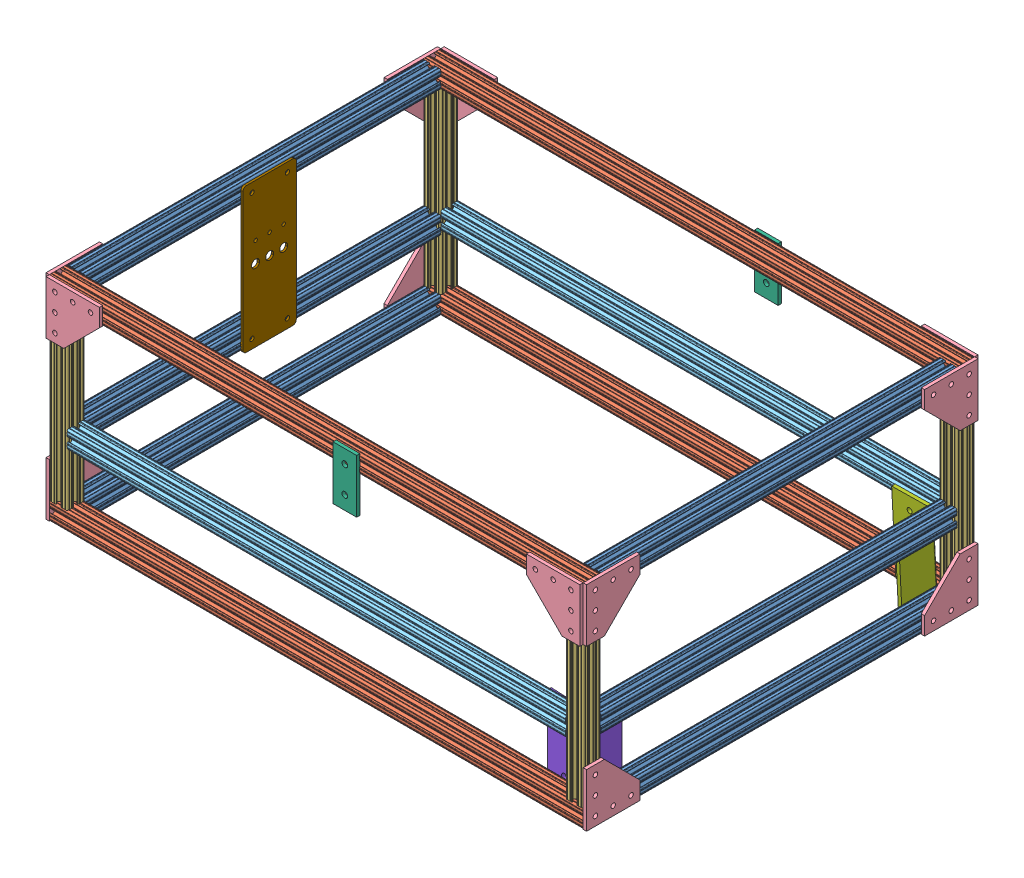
SolidWorks assembly Base Without Wheels+Plate+Angle iron+Switch Plate.SLDASM, configuration Default (file format 11000). Lengths in mm.
Overall size (771.55 304.86 568.83).
33 component instances, 9 part files, 78 mates.
Components (placement in the parent):
- 1010 20in-2: 1010 20in.SLDPRT [Default] at (231.3281 508 268.5426) size (25.4 25.4 508)
- 1010 30in-1: 1010 30in.SLDPRT [Default] at (-517.9719 508 281.2426) x (0 0 1) z (-1 0 0) size (25.4 25.4 762)
- 1010 30in-2: 1010 30in.SLDPRT [Default] at (-517.9719 508 -252.1574) x (0 0 1) z (-1 0 0) size (25.4 25.4 762)
- 1010 20in-3: 1010 20in.SLDPRT [Default] at (-505.2719 508 268.5426) size (25.4 25.4 508)
- 1010 10in-1: 1010 10in.SLDPRT [Default] at (231.3281 520.7 281.2426) x (1 0 0) z (0 -1 0) size (25.4 25.4 254)
- 1010 10in-2: 1010 10in.SLDPRT [Default] at (231.3281 520.7 -252.1574) x (1 0 0) z (0 -1 0) size (25.4 25.4 254)
- 1010 10in-3: 1010 10in.SLDPRT [Default] at (-505.2719 520.7 -252.1574) x (1 0 0) z (0 -1 0) size (25.4 25.4 254)
- 1010 10in-4: 1010 10in.SLDPRT [Default] at (-505.2719 520.7 281.2426) x (1 0 0) z (0 -1 0) size (25.4 25.4 254)
- 1010 30in-3: 1010 30in.SLDPRT [Default] at (244.0281 787.4 -252.1574) x (0 0 -1) z (1 0 0) size (25.4 25.4 762)
- 1010 20in-4: 1010 20in.SLDPRT [Default] at (231.3281 787.4 268.5426) size (25.4 25.4 508)
- 1010 30in-4: 1010 30in.SLDPRT [Default] at (-517.9719 787.4 281.2426) x (0 -1 0) z (-1 0 0) size (25.4 25.4 762)
- 1010 20in-5: 1010 20in.SLDPRT [Default] at (-505.2719 787.4 268.5426) size (25.4 25.4 508)
- 4151-1: 4151.sldprt [Default] at (248.8033 495.3 255.8426) x (0 0 1) z (-1 0 0) size (76.2 76.2 4.78)
- 4151-2: 4151.sldprt [Default] at (244.0281 495.3 -226.7574) x (0 0 -1) z (1 0 0) size (76.2 76.2 4.78)
- 4151-3: 4151.sldprt [Default] at (-522.7471 533.4 293.9426) x (0 -1 0) z (1 0 0) size (76.2 76.2 4.78)
- 4151-4: 4151.sldprt [Default] at (-522.7471 495.3 -226.7574) x (0 0 -1) z (1 0 0) size (76.2 76.2 4.78)
- 4151-5: 4151.sldprt [Default] at (248.8033 800.1 -226.7574) x (0 0 -1) z (-1 0 0) size (76.2 76.2 4.78)
- 4151-6: 4151.sldprt [Default] at (248.8033 762 293.9426) x (0 1 0) z (-1 0 0) size (76.2 76.2 4.78)
- 4151-7: 4151.sldprt [Default] at (244.0281 762 293.9426) x (0 1 0) z (0 0 1) size (76.2 76.2 4.78)
- 4151-8: 4151.sldprt [Default] at (244.0281 762 -269.6326) x (0 1 0) z (0 0 1) size (76.2 76.2 4.78)
- 4151-9: 4151.sldprt [Default] at (-522.7471 762 -264.8574) x (0 1 0) z (1 0 0) size (76.2 76.2 4.78)
- 4151-10: 4151.sldprt [Default] at (-522.7471 800.1 255.8426) x (0 0 1) z (1 0 0) size (76.2 76.2 4.78)
- 4151-11: 4151.sldprt [Default] at (-517.9719 762 298.7178) x (0 1 0) z (0 0 -1) size (76.2 76.2 4.78)
- 4151-12: 4151.sldprt [Default] at (-517.9719 762 -264.8574) x (0 1 0) z (0 0 -1) size (76.2 76.2 4.78)
- 1010 28in-1: 1010 28in.SLDPRT [Default] at (-492.5719 608.8386 281.2426) x (0 0 1) z (-1 0 0) size (25.4 25.4 711.2)
- 1010 28in-2: 1010 28in.SLDPRT [Default] at (-492.5719 612.9856 -252.1574) x (0 0 1) z (-1 0 0) size (25.4 25.4 711.2)
- 1010 20in-6: 1010 20in.SLDPRT [Default] at (231.3281 612.74 268.5426) size (25.4 25.4 508)
- 1010 20in-7: 1010 20in.SLDPRT [Default] at (-505.2719 606.9045 268.5426) size (25.4 25.4 508)
- Mad Ants Base Design Plate-1: Mad Ants Base Design Plate.SLDPRT [Default] at (-91.9558 761.9341 293.5259) size (33.78 76.45 4.67)
- Mad Ants Base Design Plate-2: Mad Ants Base Design Plate.SLDPRT [Default] at (-53.9332 760.9111 -270.1149) size (33.78 76.45 4.67)
- Right Angle iron-1: Right Angle iron.SLDPRT [Default] at (216.7236 558.8587 -211.4769) x (0.00966 0.027218 -0.999583) z (-0.999631 -0.025135 -0.010345) size (50.8 114.3 55.88)
- Left angle part-1: Left angle part.SLDPRT [Default] at (188.8149 555.8715 265.8388) x (-0.998639 -0.00797 -0.051533) z (0.051609 -0.009544 -0.998622) size (50.8 114.3 55.88)
- Switch Plate 2.0-1: Switch Plate 2.0.SLDPRT [Default] at (-489.5851 694.8152 7.9147) x (0 0 1) z (-1 0.000592 0) size (76.2 206.3 3.05)
Mates (geometry in assembly coordinates):
- Coincident5: coincident: plane of 1010 20in-2 through (244.0281 514.3331 -239.4574) normal (1 0 0); plane of 1010 30in-1 through (244.0281 500.3292 279.5333) normal (1 0 0)
- Coincident6: coincident: plane of 1010 20in-2 through (229.6188 500.3292 268.5426) normal (0 0 1); plane of 1010 30in-1 through (244.0281 498.4496 268.5426) normal (0 0 -1)
- Coincident7: coincident: plane of 1010 20in-2 through (221.7776 520.7 -239.4574) normal (0 1 0); plane of 1010 30in-1 through (244.0281 520.7 271.6921) normal (0 1 0)
- Coincident8: coincident: plane of 1010 20in-2 through (229.6188 500.3292 -239.4574) normal (0 0 -1); plane of 1010 30in-2 through (244.0281 514.3331 -239.4574) normal (0 0 1)
- Coincident9: coincident: plane of 1010 20in-2 through (244.0281 514.3331 -239.4574) normal (1 0 0); plane of 1010 30in-2 through (244.0281 500.3292 -253.8667) normal (1 0 0)
- Coincident10: coincident: plane of 1010 20in-2 through (221.7776 520.7 -239.4574) normal (0 1 0); plane of 1010 30in-2 through (244.0281 520.7 -242.607) normal (0 1 0)
- Coincident11: coincident: plane of 1010 30in-2 through (244.0281 514.3331 -239.4574) normal (0 0 1); plane of 1010 20in-3 through (-506.9812 500.3292 -239.4574) normal (0 0 -1)
- Coincident12: coincident: plane of 1010 30in-2 through (244.0281 520.7 -242.607) normal (0 1 0); plane of 1010 20in-3 through (-514.8224 520.7 -239.4574) normal (0 1 0)
- Coincident13: coincident: plane of 1010 30in-2 through (-517.9719 500.3292 -253.8667) normal (-1 0 0); plane of 1010 20in-3 through (-517.9719 514.3331 -239.4574) normal (-1 0 0)
- Coincident14: coincident: plane of 1010 30in-1 through (244.0281 520.7 271.6921) normal (0 1 0); plane of 1010 10in-1 through (229.6188 520.7 273.5718) normal (0 -1 0)
- Coincident15: coincident: plane of 1010 30in-1 through (244.0281 500.3292 279.5333) normal (1 0 0); plane of 1010 10in-1 through (244.0281 774.7 287.5756) normal (1 0 0)
- Coincident16: coincident: plane of 1010 30in-1 through (244.0281 514.3331 293.9426) normal (0 0 1); plane of 1010 10in-1 through (221.7776 774.7 293.9426) normal (0 0 1)
- Coincident17: coincident: plane of 1010 30in-2 through (244.0281 520.7 -261.7079) normal (0 1 0); plane of 1010 10in-2 through (229.6188 520.7 -259.8282) normal (0 -1 0)
- Coincident18: coincident: plane of 1010 30in-2 through (244.0281 500.3292 -253.8667) normal (1 0 0); plane of 1010 10in-2 through (244.0281 774.7 -245.8244) normal (1 0 0)
- Coincident19: coincident: plane of 1010 30in-2 through (244.0281 514.3331 -264.8574) normal (0 0 -1); plane of 1010 10in-2 through (224.9949 774.7 -264.8574) normal (0 0 -1)
- Coincident20: coincident: plane of 1010 30in-2 through (244.0281 520.7 -261.7079) normal (0 1 0); plane of 1010 10in-3 through (-506.9812 520.7 -259.8282) normal (0 -1 0)
- Coincident21: coincident: plane of 1010 30in-2 through (-517.9719 500.3292 -253.8667) normal (-1 0 0); plane of 1010 10in-3 through (-517.9719 774.7 -261.7078) normal (-1 0 0)
- Coincident22: coincident: plane of 1010 30in-2 through (244.0281 514.3331 -264.8574) normal (0 0 -1); plane of 1010 10in-3 through (-511.6051 774.7 -264.8574) normal (0 0 -1)
- Coincident23: coincident: plane of 1010 30in-1 through (244.0281 520.7 271.6921) normal (0 1 0); plane of 1010 10in-4 through (-506.9812 520.7 273.5718) normal (0 -1 0)
- Coincident24: coincident: plane of 1010 30in-1 through (-517.9719 500.3292 279.5333) normal (-1 0 0); plane of 1010 10in-4 through (-517.9719 774.7 287.5756) normal (-1 0 0)
- Coincident25: coincident: plane of 1010 30in-1 through (244.0281 514.3331 293.9426) normal (0 0 1); plane of 1010 10in-4 through (-514.8224 774.7 293.9426) normal (0 0 1)
- Coincident28: coincident: plane of 1010 10in-2 through (229.6188 774.7 -259.8282) normal (0 1 0); plane of 1010 30in-3 through (-517.9719 774.7 -245.8243) normal (0 -1 0)
- Coincident29: coincident: plane of 1010 10in-2 through (244.0281 774.7 -261.7078) normal (1 0 0); plane of 1010 30in-3 through (244.0281 779.7292 -250.4482) normal (1 0 0)
- Coincident30: coincident: plane of 1010 10in-2 through (221.7776 774.7 -239.4574) normal (0 0 1); plane of 1010 30in-3 through (-517.9719 793.7331 -239.4574) normal (0 0 1)
- Coincident31: coincident: plane of 1010 30in-3 through (-517.9719 793.7331 -239.4574) normal (0 0 1); plane of 1010 20in-4 through (229.6188 779.7292 -239.4574) normal (0 0 -1)
- Coincident32: coincident: plane of 1010 30in-3 through (244.0281 779.7292 -250.4482) normal (1 0 0); plane of 1010 20in-4 through (244.0281 793.7331 -239.4574) normal (1 0 0)
- Coincident33: coincident: plane of 1010 30in-3 through (-517.9719 800.1 -242.607) normal (0 1 0); plane of 1010 20in-4 through (221.7776 800.1 -239.4574) normal (0 1 0)
- Coincident34: coincident: plane of 1010 20in-4 through (244.0281 793.7331 -239.4574) normal (1 0 0); plane of 1010 30in-4 through (244.0281 789.1093 273.5718) normal (1 0 0)
- Coincident35: coincident: plane of 1010 20in-4 through (229.6188 779.7292 268.5426) normal (0 0 1); plane of 1010 30in-4 through (244.0281 793.7331 268.5426) normal (0 0 -1)
- Coincident36: coincident: plane of 1010 20in-4 through (221.7776 800.1 -239.4574) normal (0 1 0); plane of 1010 30in-4 through (244.0281 800.1 271.6922) normal (0 1 0)
- Coincident37: coincident: plane of 1010 30in-3 through (-517.9719 793.7331 -239.4574) normal (0 0 1); plane of 1010 20in-5 through (-506.9812 779.7292 -239.4574) normal (0 0 -1)
- Coincident38: coincident: plane of 1010 30in-3 through (-517.9719 800.1 -242.607) normal (0 1 0); plane of 1010 20in-5 through (-514.8224 800.1 -239.4574) normal (0 1 0)
- Coincident39: coincident: plane of 1010 30in-3 through (-517.9719 779.7292 -250.4482) normal (-1 0 0); plane of 1010 20in-5 through (-517.9719 777.8496 -239.4574) normal (-1 0 0)
- Coincident40: coincident: plane of 1010 30in-1 through (244.0281 498.4496 293.9426) normal (0 0 1); plane of 4151-1 through (248.8033 495.3 293.9426) normal (0 0 1)
- Coincident41: coincident: plane of 1010 30in-1 through (244.0281 500.3292 279.5333) normal (1 0 0); plane of 4151-1 through (244.0281 495.3 255.8426) normal (-1 0 0)
- Tangent1: tangent: cylinder of 1010 30in-1 through (244.0281 497.4082 291.8344) axis (-1 0 0) radius 2.1082; plane of 4151-1 through (248.8033 495.3 217.7426) normal (0 -1 0)
- Coincident42: coincident: plane of 1010 30in-2 through (244.0281 500.3292 -253.8667) normal (1 0 0); plane of 4151-2 through (244.0281 495.3 -226.7574) normal (-1 0 0)
- Coincident43: coincident: plane of 1010 30in-2 through (244.0281 495.3 -245.8243) normal (0 -1 0); plane of 4151-2 through (244.0281 495.3 -188.6574) normal (0 -1 0)
- Coincident44: coincident: plane of 1010 30in-2 through (244.0281 498.4496 -264.8574) normal (0 0 -1); plane of 4151-2 through (244.0281 495.3 -264.8574) normal (0 0 -1)
- Coincident45: coincident: plane of 1010 30in-1 through (-517.9719 500.3292 279.5333) normal (-1 0 0); plane of 4151-3 through (-517.9719 533.4 293.9426) normal (1 0 0)
- Coincident46: coincident: plane of 1010 30in-1 through (244.0281 514.3331 293.9426) normal (0 0 1); plane of 4151-3 through (-522.7471 571.5 293.9426) normal (0 0 1)
- Coincident47: coincident: plane of 1010 20in-3 through (-511.6051 495.3 -239.4574) normal (0 -1 0); plane of 4151-3 through (-522.7471 495.3 293.9426) normal (0 -1 0)
- Coincident48: coincident: plane of 1010 30in-2 through (-517.9719 500.3292 -253.8667) normal (-1 0 0); plane of 4151-4 through (-517.9719 495.3 -226.7574) normal (1 0 0)
- Coincident49: coincident: plane of 1010 30in-2 through (244.0281 495.3 -245.8243) normal (0 -1 0); plane of 4151-4 through (-522.7471 495.3 -188.6574) normal (0 -1 0)
- Coincident50: coincident: plane of 1010 10in-3 through (-511.6051 774.7 -264.8574) normal (0 0 -1); plane of 4151-4 through (-522.7471 495.3 -264.8574) normal (0 0 -1)
- Coincident51: coincident: plane of 1010 30in-3 through (244.0281 779.7292 -250.4482) normal (1 0 0); plane of 4151-5 through (244.0281 800.1 -226.7574) normal (-1 0 0)
- Coincident52: coincident: plane of 1010 30in-3 through (-517.9719 800.1 -242.607) normal (0 1 0); plane of 4151-5 through (248.8033 800.1 -188.6574) normal (0 1 0)
- Coincident53: coincident: plane of 1010 30in-3 through (-517.9719 793.7331 -264.8574) normal (0 0 -1); plane of 4151-5 through (248.8033 800.1 -264.8574) normal (0 0 -1)
- Coincident54: coincident: plane of 1010 30in-4 through (244.0281 789.1093 273.5718) normal (1 0 0); plane of 4151-6 through (244.0281 762 293.9426) normal (-1 0 0)
- Coincident55: coincident: plane of 1010 30in-4 through (244.0281 796.9504 293.9426) normal (0 0 1); plane of 4151-6 through (248.8033 723.9 293.9426) normal (0 0 1)
- Coincident56: coincident: plane of 1010 20in-4 through (240.8785 800.1 -239.4574) normal (0 1 0); plane of 4151-6 through (248.8033 800.1 293.9426) normal (0 1 0)
- Coincident57: coincident: plane of 1010 30in-4 through (244.0281 796.9504 293.9426) normal (0 0 1); plane of 4151-7 through (244.0281 762 293.9426) normal (0 0 -1)
- Coincident58: coincident: plane of 1010 30in-4 through (244.0281 800.1 287.5756) normal (0 1 0); plane of 4151-7 through (244.0281 800.1 293.9426) normal (0 1 0)
- Coincident59: coincident: line of 4151-6 through (244.0281 723.9 293.9426) axis (0 1 0); plane of 4151-7 through (244.0281 723.9 293.9426) normal (1 0 0)
- Coincident60: coincident: plane of 1010 30in-3 through (-517.9719 793.7331 -264.8574) normal (0 0 -1); plane of 4151-8 through (244.0281 762 -264.8574) normal (0 0 1)
- Coincident61: coincident: plane of 1010 30in-3 through (-517.9719 800.1 -261.7079) normal (0 1 0); plane of 4151-8 through (244.0281 800.1 -269.6326) normal (0 1 0)
- Coincident62: coincident: line of 4151-5 through (244.0281 800.1 -264.8574) axis (0 -1 0); plane of 4151-8 through (244.0281 723.9 -269.6326) normal (1 0 0)
- Coincident63: coincident: plane of 1010 30in-3 through (-517.9719 779.7292 -250.4482) normal (-1 0 0); plane of 4151-9 through (-517.9719 762 -264.8574) normal (1 0 0)
- Coincident64: coincident: plane of 1010 30in-3 through (-517.9719 800.1 -242.607) normal (0 1 0); plane of 4151-9 through (-522.7471 800.1 -264.8574) normal (0 1 0)
- Coincident65: coincident: plane of 1010 30in-3 through (-517.9719 793.7331 -264.8574) normal (0 0 -1); plane of 4151-9 through (-522.7471 723.9 -264.8574) normal (0 0 -1)
- Coincident66: coincident: plane of 1010 30in-4 through (-517.9719 789.1093 273.5718) normal (-1 0 0); plane of 4151-10 through (-517.9719 800.1 255.8426) normal (1 0 0)
- Coincident67: coincident: plane of 1010 30in-4 through (244.0281 800.1 271.6922) normal (0 1 0); plane of 4151-10 through (-522.7471 800.1 217.7426) normal (0 1 0)
- Coincident68: coincident: plane of 1010 30in-4 through (244.0281 796.9504 293.9426) normal (0 0 1); plane of 4151-10 through (-522.7471 800.1 293.9426) normal (0 0 1)
- Coincident69: coincident: plane of 1010 30in-4 through (244.0281 796.9504 293.9426) normal (0 0 1); plane of 4151-11 through (-517.9719 762 293.9426) normal (0 0 -1)
- Coincident70: coincident: plane of 1010 30in-4 through (244.0281 800.1 287.5756) normal (0 1 0); plane of 4151-11 through (-517.9719 800.1 298.7178) normal (0 1 0)
- Coincident71: coincident: line of 4151-10 through (-517.9719 800.1 293.9426) axis (0 -1 0); plane of 4151-11 through (-517.9719 723.9 298.7178) normal (-1 0 0)
- Coincident72: coincident: plane of 1010 30in-3 through (-517.9719 793.7331 -264.8574) normal (0 0 -1); plane of 4151-12 through (-517.9719 762 -264.8574) normal (0 0 1)
- Coincident73: coincident: plane of 1010 30in-3 through (-517.9719 800.1 -261.7079) normal (0 1 0); plane of 4151-12 through (-517.9719 800.1 -264.8574) normal (0 1 0)
- Coincident74: coincident: line of 4151-9 through (-517.9719 723.9 -264.8574) axis (0 1 0); plane of 4151-12 through (-517.9719 723.9 -264.8574) normal (-1 0 0)
- Coincident75: coincident: plane of 1010 10in-1 through (218.6281 774.7 271.6922) normal (-1 0 0); plane of 1010 28in-1 through (218.6281 601.1678 279.5333) normal (1 0 0)
- Coincident76: coincident: plane of 1010 10in-2 through (218.6281 774.7 -261.7078) normal (-1 0 0); plane of 1010 28in-2 through (218.6281 605.3148 -253.8667) normal (1 0 0)
- Coincident77: coincident: plane of 1010 10in-2 through (224.9949 774.7 -264.8574) normal (0 0 -1); plane of 1010 28in-2 through (218.6281 619.3187 -264.8574) normal (0 0 -1)
- Coincident78: coincident: plane of 1010 10in-1 through (221.7776 774.7 293.9426) normal (0 0 1); plane of 1010 28in-1 through (218.6281 615.1717 293.9426) normal (0 0 1)
- Coincident79: coincident: plane of 1010 10in-2 through (240.8785 774.7 -239.4574) normal (0 0 1); plane of 1010 20in-6 through (229.6188 605.0692 -239.4574) normal (0 0 -1)
- Coincident80: coincident: plane of 1010 10in-2 through (244.0281 774.7 -245.8244) normal (1 0 0); plane of 1010 20in-6 through (244.0281 619.0731 -239.4574) normal (1 0 0)
- Coincident81: coincident: plane of 1010 10in-3 through (-514.8224 774.7 -239.4574) normal (0 0 1); plane of 1010 20in-7 through (-506.9812 599.2337 -239.4574) normal (0 0 -1)
- Coincident82: coincident: plane of 1010 10in-3 through (-517.9719 774.7 -245.8244) normal (-1 0 0); plane of 1010 20in-7 through (-517.9719 613.2376 -239.4574) normal (-1 0 0)
- Coincident85: coincident: line of 1010 20in-5 through (-492.5721 797.9664 -239.4574) axis (0 0 1); line of Switch Plate 2.0-1 through (-492.5721 797.9664 40.9347) axis (0 0 -1)
